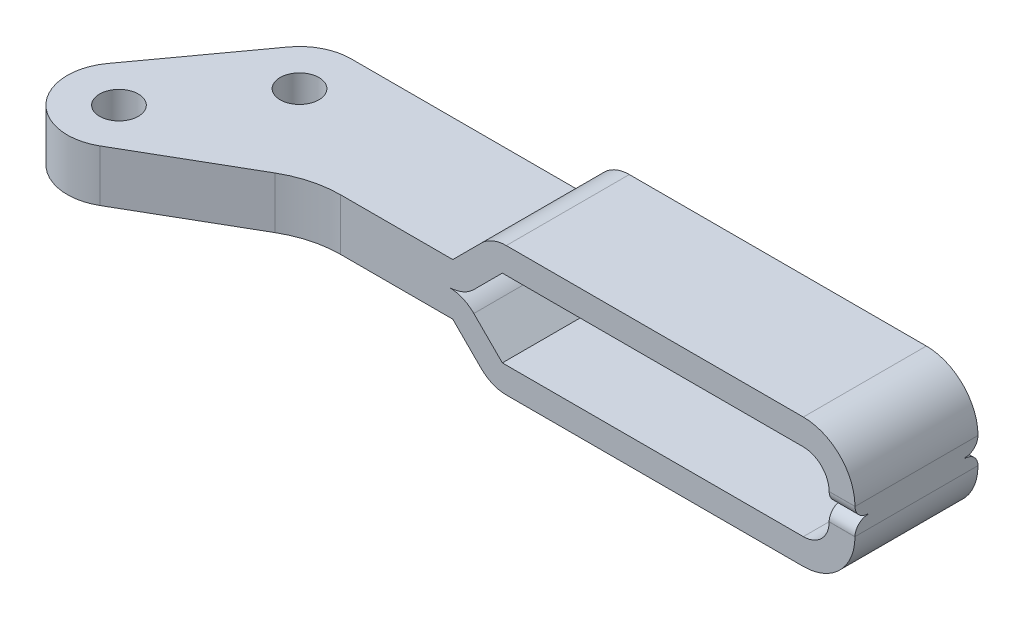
ISO-10303-21;
HEADER;
FILE_DESCRIPTION(('STEP AP214'),'2;1');
FILE_NAME('part.step','',(''),(''),'','','');
FILE_SCHEMA(('AUTOMOTIVE_DESIGN { 1 0 10303 214 1 1 1 1 }'));
ENDSEC;
DATA;
#1=APPLICATION_CONTEXT('core data for automotive mechanical design processes');
#2=APPLICATION_PROTOCOL_DEFINITION('international standard','automotive_design',2000,#1);
#3=PRODUCT_CONTEXT('',#1,'mechanical');
#4=PRODUCT('Part','Part','',(#3));
#5=PRODUCT_RELATED_PRODUCT_CATEGORY('part','',(#4));
#6=PRODUCT_DEFINITION_FORMATION('','',#4);
#7=PRODUCT_DEFINITION_CONTEXT('part definition',#1,'design');
#8=PRODUCT_DEFINITION('design','',#6,#7);
#9=PRODUCT_DEFINITION_SHAPE('','',#8);
#10=(LENGTH_UNIT() NAMED_UNIT(*) SI_UNIT(.MILLI.,.METRE.));
#11=(NAMED_UNIT(*) PLANE_ANGLE_UNIT() SI_UNIT($,.RADIAN.));
#12=(NAMED_UNIT(*) SI_UNIT($,.STERADIAN.) SOLID_ANGLE_UNIT());
#13=UNCERTAINTY_MEASURE_WITH_UNIT(LENGTH_MEASURE(1.E-05),#10,'distance_accuracy_value','');
#14=(GEOMETRIC_REPRESENTATION_CONTEXT(3) GLOBAL_UNCERTAINTY_ASSIGNED_CONTEXT((#13)) GLOBAL_UNIT_ASSIGNED_CONTEXT((#10,
#11,#12)) REPRESENTATION_CONTEXT('',''));
#15=CARTESIAN_POINT('',(0.,0.,0.));
#16=DIRECTION('',(0.,0.,1.));
#17=DIRECTION('',(1.,0.,0.));
#18=AXIS2_PLACEMENT_3D('',#15,#16,#17);
#19=CARTESIAN_POINT('',(52.4137206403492,1.02232003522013,-11.096318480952));
#20=DIRECTION('',(1.,0.,0.));
#21=DIRECTION('',(0.,1.,0.));
#22=AXIS2_PLACEMENT_3D('',#19,#20,#21);
#23=CYLINDRICAL_SURFACE('',#22,1.);
#24=CARTESIAN_POINT('',(54.4137206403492,1.02232003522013,-11.096318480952));
#25=DIRECTION('',(1.,0.,0.));
#26=DIRECTION('',(0.,1.,0.));
#27=AXIS2_PLACEMENT_3D('',#24,#25,#26);
#28=CIRCLE('',#27,1.);
#29=CARTESIAN_POINT('',(54.4137206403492,1.00993105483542,-12.0962417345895));
#30=VERTEX_POINT('',#29);
#31=CARTESIAN_POINT('',(54.4137206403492,0.0223200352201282,-11.096318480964));
#32=VERTEX_POINT('',#31);
#33=EDGE_CURVE('E187',#30,#32,#28,.F.);
#34=ORIENTED_EDGE('',*,*,#33,.T.);
#35=DIRECTION('',(-1.,0.,0.));
#36=VECTOR('',#35,1.);
#37=CARTESIAN_POINT('',(52.4137206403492,0.0223200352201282,-11.0963184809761));
#38=LINE('',#37,#36);
#39=CARTESIAN_POINT('',(52.4137206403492,0.0223200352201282,-11.096318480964));
#40=VERTEX_POINT('',#39);
#41=EDGE_CURVE('E439',#32,#40,#38,.T.);
#42=ORIENTED_EDGE('',*,*,#41,.T.);
#43=CARTESIAN_POINT('',(52.4137206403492,1.02232003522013,-11.096318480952));
#44=DIRECTION('',(1.,0.,0.));
#45=DIRECTION('',(0.,1.,0.));
#46=AXIS2_PLACEMENT_3D('',#43,#44,#45);
#47=CIRCLE('',#46,1.);
#48=CARTESIAN_POINT('',(52.4137206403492,1.00993105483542,-12.0962417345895));
#49=VERTEX_POINT('',#48);
#50=EDGE_CURVE('E533',#49,#40,#47,.F.);
#51=ORIENTED_EDGE('',*,*,#50,.F.);
#52=DIRECTION('',(1.,0.,0.));
#53=VECTOR('',#52,1.);
#54=CARTESIAN_POINT('',(53.4137206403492,1.00993105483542,-12.0962417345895));
#55=LINE('',#54,#53);
#56=EDGE_CURVE('E431',#49,#30,#55,.T.);
#57=ORIENTED_EDGE('',*,*,#56,.T.);
#58=EDGE_LOOP('',(#34,#42,#51,#57));
#59=FACE_BOUND('',#58,.T.);
#60=ADVANCED_FACE('F14',(#59),#23,.T.);
#61=CARTESIAN_POINT('',(52.4137206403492,1.02232003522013,-3.5713184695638));
#62=DIRECTION('',(1.,0.,0.));
#63=DIRECTION('',(0.,1.,0.));
#64=AXIS2_PLACEMENT_3D('',#61,#62,#63);
#65=CYLINDRICAL_SURFACE('',#64,1.);
#66=CARTESIAN_POINT('',(52.4137206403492,1.02232003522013,-3.5713184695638));
#67=DIRECTION('',(1.,0.,0.));
#68=DIRECTION('',(0.,1.,0.));
#69=AXIS2_PLACEMENT_3D('',#66,#67,#68);
#70=CIRCLE('',#69,1.);
#71=CARTESIAN_POINT('',(52.4137206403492,0.0223200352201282,-3.57131847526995));
#72=VERTEX_POINT('',#71);
#73=CARTESIAN_POINT('',(52.4137206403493,1.00993105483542,-2.57139521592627));
#74=VERTEX_POINT('',#73);
#75=EDGE_CURVE('E442',#72,#74,#70,.F.);
#76=ORIENTED_EDGE('',*,*,#75,.F.);
#77=DIRECTION('',(-1.,0.,0.));
#78=VECTOR('',#77,1.);
#79=CARTESIAN_POINT('',(52.4137206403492,0.0223200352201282,-3.57131848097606));
#80=LINE('',#79,#78);
#81=CARTESIAN_POINT('',(54.4137206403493,0.0223200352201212,-3.57131847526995));
#82=VERTEX_POINT('',#81);
#83=EDGE_CURVE('E434',#72,#82,#80,.F.);
#84=ORIENTED_EDGE('',*,*,#83,.T.);
#85=CARTESIAN_POINT('',(54.4137206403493,1.02232003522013,-3.57131846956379));
#86=DIRECTION('',(1.,0.,0.));
#87=DIRECTION('',(0.,1.,0.));
#88=AXIS2_PLACEMENT_3D('',#85,#86,#87);
#89=CIRCLE('',#88,1.);
#90=CARTESIAN_POINT('',(54.4137206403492,1.00993105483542,-2.57139521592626));
#91=VERTEX_POINT('',#90);
#92=EDGE_CURVE('E528',#82,#91,#89,.F.);
#93=ORIENTED_EDGE('',*,*,#92,.T.);
#94=DIRECTION('',(-1.,0.,0.));
#95=VECTOR('',#94,1.);
#96=CARTESIAN_POINT('',(53.4137206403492,1.00993105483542,-2.57139521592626));
#97=LINE('',#96,#95);
#98=EDGE_CURVE('E338',#91,#74,#97,.T.);
#99=ORIENTED_EDGE('',*,*,#98,.T.);
#100=EDGE_LOOP('',(#76,#84,#93,#99));
#101=FACE_BOUND('',#100,.T.);
#102=ADVANCED_FACE('F743',(#101),#65,.T.);
#103=CARTESIAN_POINT('',(52.4137206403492,1.02232003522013,-11.096318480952));
#104=DIRECTION('',(-1.,0.,0.));
#105=DIRECTION('',(0.,-1.,0.));
#106=AXIS2_PLACEMENT_3D('',#103,#104,#105);
#107=PLANE('',#106);
#108=ORIENTED_EDGE('',*,*,#50,.T.);
#109=DIRECTION('',(0.,1.,0.));
#110=VECTOR('',#109,1.);
#111=CARTESIAN_POINT('',(52.4137206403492,-7.80856592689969,-11.096318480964));
#112=LINE('',#111,#110);
#113=CARTESIAN_POINT('',(52.4137206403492,-0.0223200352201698,-11.096318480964));
#114=VERTEX_POINT('',#113);
#115=EDGE_CURVE('E169',#114,#40,#112,.T.);
#116=ORIENTED_EDGE('',*,*,#115,.F.);
#117=CARTESIAN_POINT('',(52.4137206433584,-1.02232003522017,-11.0963184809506));
#118=DIRECTION('',(-1.,0.,0.));
#119=DIRECTION('',(0.,-1.,0.));
#120=AXIS2_PLACEMENT_3D('',#117,#118,#119);
#121=CIRCLE('',#120,1.);
#122=CARTESIAN_POINT('',(52.4137206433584,-1.00993105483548,-12.0962417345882));
#123=VERTEX_POINT('',#122);
#124=EDGE_CURVE('E164',#123,#114,#121,.F.);
#125=ORIENTED_EDGE('',*,*,#124,.F.);
#126=DIRECTION('',(0.,0.,1.));
#127=VECTOR('',#126,1.);
#128=CARTESIAN_POINT('',(52.4137206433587,-1.00993105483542,-18.9863628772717));
#129=LINE('',#128,#127);
#130=CARTESIAN_POINT('',(52.4137206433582,-1.00993105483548,-2.57139521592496));
#131=VERTEX_POINT('',#130);
#132=EDGE_CURVE('E152',#123,#131,#129,.T.);
#133=ORIENTED_EDGE('',*,*,#132,.T.);
#134=CARTESIAN_POINT('',(52.4137206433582,-1.02232003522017,-3.57131846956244));
#135=DIRECTION('',(-1.,0.,0.));
#136=DIRECTION('',(0.,-1.,0.));
#137=AXIS2_PLACEMENT_3D('',#134,#135,#136);
#138=CIRCLE('',#137,1.);
#139=CARTESIAN_POINT('',(52.4137206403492,-0.022320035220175,-3.57131847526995));
#140=VERTEX_POINT('',#139);
#141=EDGE_CURVE('E133',#140,#131,#138,.F.);
#142=ORIENTED_EDGE('',*,*,#141,.F.);
#143=DIRECTION('',(0.,1.,0.));
#144=VECTOR('',#143,1.);
#145=CARTESIAN_POINT('',(52.4137206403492,-7.80856592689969,-3.57131847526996));
#146=LINE('',#145,#144);
#147=EDGE_CURVE('E510',#140,#72,#146,.T.);
#148=ORIENTED_EDGE('',*,*,#147,.T.);
#149=ORIENTED_EDGE('',*,*,#75,.T.);
#150=DIRECTION('',(0.,0.,1.));
#151=VECTOR('',#150,1.);
#152=CARTESIAN_POINT('',(52.4137206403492,1.00993105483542,-18.1473394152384));
#153=LINE('',#152,#151);
#154=EDGE_CURVE('E375',#74,#49,#153,.F.);
#155=ORIENTED_EDGE('',*,*,#154,.T.);
#156=EDGE_LOOP('',(#108,#116,#125,#133,#142,#148,#149,#155));
#157=FACE_BOUND('',#156,.T.);
#158=ADVANCED_FACE('F166',(#157),#107,.T.);
#159=CARTESIAN_POINT('',(54.4136865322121,1.02644964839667,-12.096318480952));
#160=CARTESIAN_POINT('',(54.4137092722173,1.02094317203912,-12.0963120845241));
#161=CARTESIAN_POINT('',(54.4137206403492,1.01543695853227,-12.0962865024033));
#162=CARTESIAN_POINT('',(54.4137206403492,1.00993105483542,-12.0962417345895));
#163=CARTESIAN_POINT('',(52.4137035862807,1.01819035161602,-12.096318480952));
#164=CARTESIAN_POINT('',(52.4137149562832,1.01543711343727,-12.0963120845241));
#165=CARTESIAN_POINT('',(52.4137206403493,1.01268400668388,-12.0962865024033));
#166=CARTESIAN_POINT('',(52.4137206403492,1.00993105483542,-12.0962417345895));
#167=B_SPLINE_SURFACE_WITH_KNOTS('',1,3,((#159,#160,#161,#162),(#163,#164,#165,#166)),
.UNSPECIFIED.,.F.,.F.,.F.,(2,2),(4,4),(0.,1.),(0.,1.),.UNSPECIFIED.);
#168=CARTESIAN_POINT('',(54.4137206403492,1.00993105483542,-12.0962417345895));
#169=CARTESIAN_POINT('',(54.4137206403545,1.01130764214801,-12.0962529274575));
#170=CARTESIAN_POINT('',(54.4137199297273,1.01268423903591,-12.0962629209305));
#171=CARTESIAN_POINT('',(54.4137170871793,1.01543744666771,-12.0962805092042));
#172=CARTESIAN_POINT('',(54.4137149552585,1.01681405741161,-12.096288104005));
#173=CARTESIAN_POINT('',(54.4137064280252,1.02094365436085,-12.0963072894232));
#174=CARTESIAN_POINT('',(54.4136979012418,1.02369665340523,-12.0963152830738));
#175=CARTESIAN_POINT('',(54.4136865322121,1.02644964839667,-12.096318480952));
#176=B_SPLINE_CURVE_WITH_KNOTS('',3,(#168,#169,#170,#171,#172,#173,#174,#175),.UNSPECIFIED.,.F.,
.F.,(4,2,2,4),(0.,0.00412989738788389,0.00825979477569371,0.0165188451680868),.UNSPECIFIED.);
#177=CARTESIAN_POINT('',(54.4136865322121,1.02644964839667,-12.096318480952));
#178=VERTEX_POINT('',#177);
#179=EDGE_CURVE('E339',#30,#178,#176,.T.);
#180=CARTESIAN_POINT('',(52.4137206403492,1.00993105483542,-12.0962417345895));
#181=CARTESIAN_POINT('',(52.413720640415,1.01130746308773,-12.096264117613));
#182=CARTESIAN_POINT('',(52.4137192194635,1.01268394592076,-12.0962817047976));
#183=CARTESIAN_POINT('',(52.4137149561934,1.01474876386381,-12.0963008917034));
#184=CARTESIAN_POINT('',(52.4137131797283,1.01543706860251,-12.0963060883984));
#185=CARTESIAN_POINT('',(52.4137089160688,1.01681369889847,-12.0963140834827));
#186=CARTESIAN_POINT('',(52.413706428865,1.01750202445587,-12.0963168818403));
#187=CARTESIAN_POINT('',(52.4137035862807,1.01819035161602,-12.096318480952));
#188=B_SPLINE_CURVE_WITH_KNOTS('',3,(#180,#181,#182,#183,#184,#185,#186,#187),.UNSPECIFIED.,.F.,
.F.,(4,2,2,4),(0.,0.00412975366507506,0.00619472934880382,0.00825973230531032),.UNSPECIFIED.);
#189=CARTESIAN_POINT('',(52.4137035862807,1.01819035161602,-12.096318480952));
#190=VERTEX_POINT('',#189);
#191=EDGE_CURVE('E367',#49,#190,#188,.T.);
#192=DIRECTION('',(0.999991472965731,0.00412964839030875,0.));
#193=VECTOR('',#192,1.);
#194=CARTESIAN_POINT('',(52.4137035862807,1.01819035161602,-12.096318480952));
#195=LINE('',#194,#193);
#196=EDGE_CURVE('E378',#190,#178,#195,.T.);
#197=ORIENTED_EDGE('',*,*,#179,.F.);
#198=ORIENTED_EDGE('',*,*,#56,.F.);
#199=ORIENTED_EDGE('',*,*,#191,.T.);
#200=ORIENTED_EDGE('',*,*,#196,.T.);
#201=EDGE_LOOP('',(#197,#198,#199,#200));
#202=FACE_BOUND('',#201,.T.);
#203=ADVANCED_FACE('F309',(#202),#167,.F.);
#204=CARTESIAN_POINT('',(54.4137206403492,1.00993105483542,-2.57139521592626));
#205=CARTESIAN_POINT('',(54.4137206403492,1.01543695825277,-2.57135044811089));
#206=CARTESIAN_POINT('',(54.4137092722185,1.02094317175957,-2.57132486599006));
#207=CARTESIAN_POINT('',(54.4136865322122,1.02644964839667,-2.57131846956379));
#208=CARTESIAN_POINT('',(52.4137206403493,1.00993105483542,-2.57139521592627));
#209=CARTESIAN_POINT('',(52.4137206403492,1.01268400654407,-2.5713504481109));
#210=CARTESIAN_POINT('',(52.4137149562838,1.01543711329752,-2.57132486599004));
#211=CARTESIAN_POINT('',(52.4137035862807,1.01819035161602,-2.57131846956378));
#212=B_SPLINE_SURFACE_WITH_KNOTS('',1,3,((#204,#205,#206,#207),(#208,#209,#210,#211)),
.UNSPECIFIED.,.F.,.F.,.F.,(2,2),(4,4),(0.,1.),(0.,1.),.UNSPECIFIED.);
#213=CARTESIAN_POINT('',(54.4136865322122,1.02644964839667,-2.57131846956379));
#214=CARTESIAN_POINT('',(54.4136922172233,1.02507302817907,-2.57132006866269));
#215=CARTESIAN_POINT('',(54.4136971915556,1.02369640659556,-2.57132286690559));
#216=CARTESIAN_POINT('',(54.4137057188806,1.02094316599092,-2.57133086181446));
#217=CARTESIAN_POINT('',(54.4137092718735,1.01956654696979,-2.57133605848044));
#218=CARTESIAN_POINT('',(54.4137177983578,1.01543695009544,-2.57135524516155));
#219=CARTESIAN_POINT('',(54.413720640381,1.01268398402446,-2.57137283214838));
#220=CARTESIAN_POINT('',(54.4137206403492,1.00993105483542,-2.57139521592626));
#221=B_SPLINE_CURVE_WITH_KNOTS('',3,(#213,#214,#215,#216,#217,#218,#219,#220),.UNSPECIFIED.,.F.,
.F.,(4,2,2,4),(0.,0.00412989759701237,0.00825979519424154,0.0165188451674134),.UNSPECIFIED.);
#222=CARTESIAN_POINT('',(54.4136865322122,1.02644964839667,-2.57131846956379));
#223=VERTEX_POINT('',#222);
#224=EDGE_CURVE('E330',#223,#91,#221,.T.);
#225=DIRECTION('',(-0.999991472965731,-0.00412964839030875,0.));
#226=VECTOR('',#225,1.);
#227=CARTESIAN_POINT('',(54.4136865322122,1.02644964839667,-2.57131846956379));
#228=LINE('',#227,#226);
#229=CARTESIAN_POINT('',(52.4137035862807,1.01819035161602,-2.57131846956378));
#230=VERTEX_POINT('',#229);
#231=EDGE_CURVE('E382',#223,#230,#228,.T.);
#232=CARTESIAN_POINT('',(52.4137035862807,1.01819035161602,-2.57131846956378));
#233=CARTESIAN_POINT('',(52.4137092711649,1.01681377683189,-2.57132166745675));
#234=CARTESIAN_POINT('',(52.4137135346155,1.01543721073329,-2.57132966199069));
#235=CARTESIAN_POINT('',(52.4137177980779,1.01337239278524,-2.57134884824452));
#236=CARTESIAN_POINT('',(52.4137188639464,1.01268410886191,-2.57135644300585));
#237=CARTESIAN_POINT('',(52.4137202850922,1.01130756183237,-2.57137403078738));
#238=CARTESIAN_POINT('',(52.4137206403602,1.01061929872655,-2.57138402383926));
#239=CARTESIAN_POINT('',(52.4137206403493,1.00993105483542,-2.57139521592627));
#240=B_SPLINE_CURVE_WITH_KNOTS('',3,(#232,#233,#234,#235,#236,#237,#238,#239),.UNSPECIFIED.,.F.,
.F.,(4,2,2,4),(0.,0.00412975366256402,0.00619472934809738,0.00825973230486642),.UNSPECIFIED.);
#241=EDGE_CURVE('E322',#230,#74,#240,.T.);
#242=ORIENTED_EDGE('',*,*,#224,.F.);
#243=ORIENTED_EDGE('',*,*,#231,.T.);
#244=ORIENTED_EDGE('',*,*,#241,.T.);
#245=ORIENTED_EDGE('',*,*,#98,.F.);
#246=EDGE_LOOP('',(#242,#243,#244,#245));
#247=FACE_BOUND('',#246,.T.);
#248=ADVANCED_FACE('F302',(#247),#212,.F.);
#249=CARTESIAN_POINT('',(50.4137206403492,1.00993105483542,-18.1473394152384));
#250=DIRECTION('',(0.,0.,1.));
#251=DIRECTION('',(0.,-1.,0.));
#252=AXIS2_PLACEMENT_3D('',#249,#250,#251);
#253=CYLINDRICAL_SURFACE('',#252,2.);
#254=CARTESIAN_POINT('',(50.4137206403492,1.00993105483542,-12.096318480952));
#255=DIRECTION('',(0.,0.,1.));
#256=DIRECTION('',(0.,-1.,0.));
#257=AXIS2_PLACEMENT_3D('',#254,#255,#256);
#258=CIRCLE('',#257,2.);
#259=CARTESIAN_POINT('',(50.4137206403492,3.00993105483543,-12.096318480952));
#260=VERTEX_POINT('',#259);
#261=EDGE_CURVE('E374',#260,#190,#258,.F.);
#262=ORIENTED_EDGE('',*,*,#261,.T.);
#263=ORIENTED_EDGE('',*,*,#191,.F.);
#264=ORIENTED_EDGE('',*,*,#154,.F.);
#265=ORIENTED_EDGE('',*,*,#241,.F.);
#266=CARTESIAN_POINT('',(50.4137206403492,1.00993105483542,-2.57131846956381));
#267=DIRECTION('',(0.,0.,1.));
#268=DIRECTION('',(0.,-1.,0.));
#269=AXIS2_PLACEMENT_3D('',#266,#267,#268);
#270=CIRCLE('',#269,2.);
#271=CARTESIAN_POINT('',(50.4137206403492,3.00993105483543,-2.57131846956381));
#272=VERTEX_POINT('',#271);
#273=EDGE_CURVE('E379',#230,#272,#270,.T.);
#274=ORIENTED_EDGE('',*,*,#273,.T.);
#275=DIRECTION('',(0.,0.,1.));
#276=VECTOR('',#275,1.);
#277=CARTESIAN_POINT('',(50.4137206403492,3.00993105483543,-11.096318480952));
#278=LINE('',#277,#276);
#279=EDGE_CURVE('E387',#260,#272,#278,.T.);
#280=ORIENTED_EDGE('',*,*,#279,.F.);
#281=EDGE_LOOP('',(#262,#263,#264,#265,#274,#280));
#282=FACE_BOUND('',#281,.T.);
#283=ADVANCED_FACE('F308',(#282),#253,.F.);
#284=CARTESIAN_POINT('',(54.4137206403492,1.02232003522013,-11.096318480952));
#285=DIRECTION('',(-1.,0.,0.));
#286=DIRECTION('',(0.,-1.,0.));
#287=AXIS2_PLACEMENT_3D('',#284,#285,#286);
#288=PLANE('',#287);
#289=DIRECTION('',(0.,0.,1.));
#290=VECTOR('',#289,1.);
#291=CARTESIAN_POINT('',(54.4137206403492,1.00993105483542,-18.1473394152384));
#292=LINE('',#291,#290);
#293=EDGE_CURVE('E386',#91,#30,#292,.F.);
#294=ORIENTED_EDGE('',*,*,#293,.F.);
#295=ORIENTED_EDGE('',*,*,#92,.F.);
#296=DIRECTION('',(0.,1.,0.));
#297=VECTOR('',#296,1.);
#298=CARTESIAN_POINT('',(54.4137206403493,-7.80856592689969,-3.57131847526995));
#299=LINE('',#298,#297);
#300=CARTESIAN_POINT('',(54.4137206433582,-0.0223200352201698,-3.57131847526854));
#301=VERTEX_POINT('',#300);
#302=EDGE_CURVE('E508',#301,#82,#299,.T.);
#303=ORIENTED_EDGE('',*,*,#302,.F.);
#304=CARTESIAN_POINT('',(54.4137206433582,-1.02232003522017,-3.57131846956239));
#305=DIRECTION('',(-1.,0.,0.));
#306=DIRECTION('',(0.,-1.,0.));
#307=AXIS2_PLACEMENT_3D('',#304,#305,#306);
#308=CIRCLE('',#307,1.);
#309=CARTESIAN_POINT('',(54.4137206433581,-1.00993105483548,-2.57139521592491));
#310=VERTEX_POINT('',#309);
#311=EDGE_CURVE('E525',#301,#310,#308,.F.);
#312=ORIENTED_EDGE('',*,*,#311,.T.);
#313=DIRECTION('',(0.,0.,1.));
#314=VECTOR('',#313,1.);
#315=CARTESIAN_POINT('',(54.4137206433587,-1.00993105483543,-18.9863628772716));
#316=LINE('',#315,#314);
#317=CARTESIAN_POINT('',(54.4137206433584,-1.00993105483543,-12.0962417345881));
#318=VERTEX_POINT('',#317);
#319=EDGE_CURVE('E234',#318,#310,#316,.T.);
#320=ORIENTED_EDGE('',*,*,#319,.F.);
#321=CARTESIAN_POINT('',(54.4137206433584,-1.02232003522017,-11.0963184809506));
#322=DIRECTION('',(-1.,0.,0.));
#323=DIRECTION('',(0.,-1.,0.));
#324=AXIS2_PLACEMENT_3D('',#321,#322,#323);
#325=CIRCLE('',#324,1.);
#326=CARTESIAN_POINT('',(54.4137206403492,-0.0223200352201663,-11.096318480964));
#327=VERTEX_POINT('',#326);
#328=EDGE_CURVE('E177',#318,#327,#325,.F.);
#329=ORIENTED_EDGE('',*,*,#328,.T.);
#330=DIRECTION('',(0.,1.,0.));
#331=VECTOR('',#330,1.);
#332=CARTESIAN_POINT('',(54.4137206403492,-7.80856592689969,-11.096318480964));
#333=LINE('',#332,#331);
#334=EDGE_CURVE('E505',#327,#32,#333,.T.);
#335=ORIENTED_EDGE('',*,*,#334,.T.);
#336=ORIENTED_EDGE('',*,*,#33,.F.);
#337=EDGE_LOOP('',(#294,#295,#303,#312,#320,#329,#335,#336));
#338=FACE_BOUND('',#337,.T.);
#339=ADVANCED_FACE('F357',(#338),#288,.F.);
#340=CARTESIAN_POINT('',(55.1137206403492,3.00993105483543,-11.096318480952));
#341=DIRECTION('',(0.,-1.,0.));
#342=DIRECTION('',(1.,0.,0.));
#343=AXIS2_PLACEMENT_3D('',#340,#341,#342);
#344=PLANE('',#343);
#345=DIRECTION('',(1.,0.,0.));
#346=VECTOR('',#345,1.);
#347=CARTESIAN_POINT('',(18.0692459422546,3.00993105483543,-2.5713184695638));
#348=LINE('',#347,#346);
#349=CARTESIAN_POINT('',(27.1125333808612,3.00993105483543,-2.57131846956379));
#350=VERTEX_POINT('',#349);
#351=EDGE_CURVE('E458',#272,#350,#348,.F.);
#352=ORIENTED_EDGE('',*,*,#351,.T.);
#353=DIRECTION('',(0.,0.,-1.));
#354=VECTOR('',#353,1.);
#355=CARTESIAN_POINT('',(27.1125333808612,3.00993105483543,-11.096318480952));
#356=LINE('',#355,#354);
#357=CARTESIAN_POINT('',(27.1125333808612,3.00993105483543,-12.096318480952));
#358=VERTEX_POINT('',#357);
#359=EDGE_CURVE('E461',#350,#358,#356,.T.);
#360=ORIENTED_EDGE('',*,*,#359,.T.);
#361=DIRECTION('',(1.,0.,0.));
#362=VECTOR('',#361,1.);
#363=CARTESIAN_POINT('',(55.1137206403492,3.00993105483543,-12.096318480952));
#364=LINE('',#363,#362);
#365=EDGE_CURVE('E391',#358,#260,#364,.T.);
#366=ORIENTED_EDGE('',*,*,#365,.T.);
#367=ORIENTED_EDGE('',*,*,#279,.T.);
#368=EDGE_LOOP('',(#352,#360,#366,#367));
#369=FACE_BOUND('',#368,.T.);
#370=ADVANCED_FACE('F351',(#369),#344,.T.);
#371=CARTESIAN_POINT('',(50.4137206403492,1.00993105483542,-18.1473394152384));
#372=DIRECTION('',(0.,0.,1.));
#373=DIRECTION('',(0.,-1.,0.));
#374=AXIS2_PLACEMENT_3D('',#371,#372,#373);
#375=CYLINDRICAL_SURFACE('',#374,4.);
#376=ORIENTED_EDGE('',*,*,#179,.T.);
#377=CARTESIAN_POINT('',(50.4137206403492,1.00993105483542,-12.096318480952));
#378=DIRECTION('',(0.,0.,1.));
#379=DIRECTION('',(0.,-1.,0.));
#380=AXIS2_PLACEMENT_3D('',#377,#378,#379);
#381=CIRCLE('',#380,4.);
#382=CARTESIAN_POINT('',(50.4137206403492,5.00993105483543,-12.096318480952));
#383=VERTEX_POINT('',#382);
#384=EDGE_CURVE('E388',#178,#383,#381,.T.);
#385=ORIENTED_EDGE('',*,*,#384,.T.);
#386=DIRECTION('',(0.,0.,1.));
#387=VECTOR('',#386,1.);
#388=CARTESIAN_POINT('',(50.4137206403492,5.00993105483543,-11.096318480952));
#389=LINE('',#388,#387);
#390=CARTESIAN_POINT('',(50.4137206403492,5.00993105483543,-2.57131846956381));
#391=VERTEX_POINT('',#390);
#392=EDGE_CURVE('E451',#383,#391,#389,.T.);
#393=ORIENTED_EDGE('',*,*,#392,.T.);
#394=CARTESIAN_POINT('',(50.4137206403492,1.00993105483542,-2.57131846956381));
#395=DIRECTION('',(0.,0.,1.));
#396=DIRECTION('',(0.,-1.,0.));
#397=AXIS2_PLACEMENT_3D('',#394,#395,#396);
#398=CIRCLE('',#397,4.);
#399=EDGE_CURVE('E383',#391,#223,#398,.F.);
#400=ORIENTED_EDGE('',*,*,#399,.T.);
#401=ORIENTED_EDGE('',*,*,#224,.T.);
#402=ORIENTED_EDGE('',*,*,#293,.T.);
#403=EDGE_LOOP('',(#376,#385,#393,#400,#401,#402));
#404=FACE_BOUND('',#403,.T.);
#405=ADVANCED_FACE('F345',(#404),#375,.T.);
#406=CARTESIAN_POINT('',(55.1137206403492,5.00993105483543,-11.096318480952));
#407=DIRECTION('',(0.,-1.,0.));
#408=DIRECTION('',(1.,0.,0.));
#409=AXIS2_PLACEMENT_3D('',#406,#407,#408);
#410=PLANE('',#409);
#411=DIRECTION('',(1.,0.,0.));
#412=VECTOR('',#411,1.);
#413=CARTESIAN_POINT('',(55.1137206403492,5.00993105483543,-12.096318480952));
#414=LINE('',#413,#412);
#415=CARTESIAN_POINT('',(27.4176430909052,5.00993105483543,-12.0963184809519));
#416=VERTEX_POINT('',#415);
#417=EDGE_CURVE('E455',#416,#383,#414,.T.);
#418=ORIENTED_EDGE('',*,*,#417,.F.);
#419=DIRECTION('',(0.,0.,-1.));
#420=VECTOR('',#419,1.);
#421=CARTESIAN_POINT('',(27.4176430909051,5.00993105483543,2.49399459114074));
#422=LINE('',#421,#420);
#423=CARTESIAN_POINT('',(27.4176430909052,5.00993105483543,-2.57131846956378));
#424=VERTEX_POINT('',#423);
#425=EDGE_CURVE('E396',#424,#416,#422,.T.);
#426=ORIENTED_EDGE('',*,*,#425,.F.);
#427=DIRECTION('',(1.,0.,0.));
#428=VECTOR('',#427,1.);
#429=CARTESIAN_POINT('',(55.1137206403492,5.00993105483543,-2.5713184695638));
#430=LINE('',#429,#428);
#431=EDGE_CURVE('E464',#391,#424,#430,.F.);
#432=ORIENTED_EDGE('',*,*,#431,.F.);
#433=ORIENTED_EDGE('',*,*,#392,.F.);
#434=EDGE_LOOP('',(#418,#426,#432,#433));
#435=FACE_BOUND('',#434,.T.);
#436=ADVANCED_FACE('F350',(#435),#410,.F.);
#437=CARTESIAN_POINT('',(47.4453112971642,23.3427089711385,-11.096318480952));
#438=DIRECTION('',(0.707106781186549,-0.707106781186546,0.));
#439=DIRECTION('',(0.707106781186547,0.707106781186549,0.));
#440=AXIS2_PLACEMENT_3D('',#437,#438,#439);
#441=PLANE('',#440);
#442=DIRECTION('',(-0.707106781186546,-0.707106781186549,0.));
#443=VECTOR('',#442,1.);
#444=CARTESIAN_POINT('',(26.8967882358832,2.79418590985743,-2.57131846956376));
#445=LINE('',#444,#443);
#446=CARTESIAN_POINT('',(24.9041339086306,0.801531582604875,-2.57131846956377));
#447=VERTEX_POINT('',#446);
#448=EDGE_CURVE('E399',#350,#447,#445,.T.);
#449=ORIENTED_EDGE('',*,*,#448,.T.);
#450=DIRECTION('',(0.,0.,-1.));
#451=VECTOR('',#450,1.);
#452=CARTESIAN_POINT('',(24.9041339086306,0.801531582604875,2.49399459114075));
#453=LINE('',#452,#451);
#454=CARTESIAN_POINT('',(24.9041339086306,0.801531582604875,-12.096318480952));
#455=VERTEX_POINT('',#454);
#456=EDGE_CURVE('E404',#455,#447,#453,.F.);
#457=ORIENTED_EDGE('',*,*,#456,.F.);
#458=DIRECTION('',(0.707106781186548,0.707106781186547,0.));
#459=VECTOR('',#458,1.);
#460=CARTESIAN_POINT('',(24.9041339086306,0.801531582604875,-12.096318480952));
#461=LINE('',#460,#459);
#462=EDGE_CURVE('E454',#455,#358,#461,.T.);
#463=ORIENTED_EDGE('',*,*,#462,.T.);
#464=ORIENTED_EDGE('',*,*,#359,.F.);
#465=EDGE_LOOP('',(#449,#457,#463,#464));
#466=FACE_BOUND('',#465,.T.);
#467=ADVANCED_FACE('F706',(#466),#441,.T.);
#468=CARTESIAN_POINT('',(27.4176430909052,2.27333105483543,2.49399459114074));
#469=DIRECTION('',(0.,0.,-1.));
#470=DIRECTION('',(1.,0.,0.));
#471=AXIS2_PLACEMENT_3D('',#468,#469,#470);
#472=CYLINDRICAL_SURFACE('',#471,2.7366);
#473=DIRECTION('',(0.,0.,1.));
#474=VECTOR('',#473,1.);
#475=CARTESIAN_POINT('',(25.4825746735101,4.20839947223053,-11.096318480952));
#476=LINE('',#475,#474);
#477=CARTESIAN_POINT('',(25.4825746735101,4.20839947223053,-12.0963184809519));
#478=VERTEX_POINT('',#477);
#479=CARTESIAN_POINT('',(25.4825746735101,4.20839947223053,-2.57131846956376));
#480=VERTEX_POINT('',#479);
#481=EDGE_CURVE('E409',#478,#480,#476,.T.);
#482=ORIENTED_EDGE('',*,*,#481,.T.);
#483=CARTESIAN_POINT('',(27.4176430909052,2.27333105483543,-2.57131846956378));
#484=DIRECTION('',(0.,0.,-1.));
#485=DIRECTION('',(1.,0.,0.));
#486=AXIS2_PLACEMENT_3D('',#483,#484,#485);
#487=CIRCLE('',#486,2.7366);
#488=EDGE_CURVE('E395',#480,#424,#487,.T.);
#489=ORIENTED_EDGE('',*,*,#488,.T.);
#490=ORIENTED_EDGE('',*,*,#425,.T.);
#491=CARTESIAN_POINT('',(27.4176430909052,2.27333105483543,-12.096318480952));
#492=DIRECTION('',(0.,0.,-1.));
#493=DIRECTION('',(1.,0.,0.));
#494=AXIS2_PLACEMENT_3D('',#491,#492,#493);
#495=CIRCLE('',#494,2.7366);
#496=EDGE_CURVE('E392',#416,#478,#495,.F.);
#497=ORIENTED_EDGE('',*,*,#496,.T.);
#498=EDGE_LOOP('',(#482,#489,#490,#497));
#499=FACE_BOUND('',#498,.T.);
#500=ADVANCED_FACE('F720',(#499),#472,.T.);
#501=CARTESIAN_POINT('',(22.9690654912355,2.7366,2.49399459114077));
#502=DIRECTION('',(0.,0.,-1.));
#503=DIRECTION('',(0.,1.,0.));
#504=AXIS2_PLACEMENT_3D('',#501,#502,#503);
#505=CYLINDRICAL_SURFACE('',#504,2.7366);
#506=ORIENTED_EDGE('',*,*,#456,.T.);
#507=CARTESIAN_POINT('',(22.9690654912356,2.7366,-2.5713184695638));
#508=DIRECTION('',(0.,0.,-1.));
#509=DIRECTION('',(0.,1.,0.));
#510=AXIS2_PLACEMENT_3D('',#507,#508,#509);
#511=CIRCLE('',#510,2.7366);
#512=CARTESIAN_POINT('',(22.9690654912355,0.,-2.5713184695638));
#513=VERTEX_POINT('',#512);
#514=EDGE_CURVE('E405',#513,#447,#511,.F.);
#515=ORIENTED_EDGE('',*,*,#514,.F.);
#516=DIRECTION('',(0.,0.,-1.));
#517=VECTOR('',#516,1.);
#518=CARTESIAN_POINT('',(22.9690654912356,0.,-11.096318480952));
#519=LINE('',#518,#517);
#520=CARTESIAN_POINT('',(22.9690654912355,0.,-12.096318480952));
#521=VERTEX_POINT('',#520);
#522=EDGE_CURVE('E408',#521,#513,#519,.F.);
#523=ORIENTED_EDGE('',*,*,#522,.F.);
#524=CARTESIAN_POINT('',(22.9690654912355,2.7366,-12.096318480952));
#525=DIRECTION('',(0.,0.,-1.));
#526=DIRECTION('',(0.,1.,0.));
#527=AXIS2_PLACEMENT_3D('',#524,#525,#526);
#528=CIRCLE('',#527,2.7366);
#529=EDGE_CURVE('E400',#455,#521,#528,.T.);
#530=ORIENTED_EDGE('',*,*,#529,.F.);
#531=EDGE_LOOP('',(#506,#515,#523,#530));
#532=FACE_BOUND('',#531,.T.);
#533=ADVANCED_FACE('F607',(#532),#505,.T.);
#534=CARTESIAN_POINT('',(46.0310977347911,24.7569225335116,-11.096318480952));
#535=DIRECTION('',(0.707106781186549,-0.707106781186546,0.));
#536=DIRECTION('',(0.707106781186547,0.707106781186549,0.));
#537=AXIS2_PLACEMENT_3D('',#534,#535,#536);
#538=PLANE('',#537);
#539=DIRECTION('',(0.707106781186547,0.707106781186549,0.));
#540=VECTOR('',#539,1.);
#541=CARTESIAN_POINT('',(46.0310977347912,24.7569225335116,-12.0963184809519));
#542=LINE('',#541,#540);
#543=CARTESIAN_POINT('',(23.2741752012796,2.,-12.096318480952));
#544=VERTEX_POINT('',#543);
#545=EDGE_CURVE('E473',#544,#478,#542,.T.);
#546=ORIENTED_EDGE('',*,*,#545,.F.);
#547=DIRECTION('',(0.,0.,1.));
#548=VECTOR('',#547,1.);
#549=CARTESIAN_POINT('',(23.2741752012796,2.,-11.096318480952));
#550=LINE('',#549,#548);
#551=CARTESIAN_POINT('',(23.2741752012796,2.,-2.57131846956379));
#552=VERTEX_POINT('',#551);
#553=EDGE_CURVE('E27',#544,#552,#550,.T.);
#554=ORIENTED_EDGE('',*,*,#553,.T.);
#555=DIRECTION('',(0.707106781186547,0.707106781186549,0.));
#556=VECTOR('',#555,1.);
#557=CARTESIAN_POINT('',(46.0310977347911,24.7569225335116,-2.57131846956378));
#558=LINE('',#557,#556);
#559=EDGE_CURVE('E403',#480,#552,#558,.F.);
#560=ORIENTED_EDGE('',*,*,#559,.F.);
#561=ORIENTED_EDGE('',*,*,#481,.F.);
#562=EDGE_LOOP('',(#546,#554,#560,#561));
#563=FACE_BOUND('',#562,.T.);
#564=ADVANCED_FACE('F721',(#563),#538,.F.);
#565=CARTESIAN_POINT('',(5.88231968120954,0.,-8.09631847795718));
#566=DIRECTION('',(0.,1.,0.));
#567=DIRECTION('',(0.,0.,1.));
#568=AXIS2_PLACEMENT_3D('',#565,#566,#567);
#569=CYLINDRICAL_SURFACE('',#568,1.5);
#570=CARTESIAN_POINT('',(5.88231968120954,2.,-8.09631847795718));
#571=DIRECTION('',(0.,1.,0.));
#572=DIRECTION('',(0.,0.,1.));
#573=AXIS2_PLACEMENT_3D('',#570,#571,#572);
#574=CIRCLE('',#573,1.5);
#575=CARTESIAN_POINT('',(5.88231968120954,2.,-6.59631847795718));
#576=VERTEX_POINT('',#575);
#577=EDGE_CURVE('E410',#576,#576,#574,.T.);
#578=ORIENTED_EDGE('',*,*,#577,.T.);
#579=EDGE_LOOP('',(#578));
#580=FACE_BOUND('',#579,.T.);
#581=CARTESIAN_POINT('',(5.8823196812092,-2.,-8.09631847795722));
#582=DIRECTION('',(0.,1.,0.));
#583=DIRECTION('',(-1.,0.,0.));
#584=AXIS2_PLACEMENT_3D('',#581,#582,#583);
#585=CIRCLE('',#584,1.5);
#586=CARTESIAN_POINT('',(4.3823196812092,-2.,-8.09631847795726));
#587=VERTEX_POINT('',#586);
#588=EDGE_CURVE('E184',#587,#587,#585,.T.);
#589=ORIENTED_EDGE('',*,*,#588,.F.);
#590=EDGE_LOOP('',(#589));
#591=FACE_BOUND('',#590,.T.);
#592=ADVANCED_FACE('F781',(#580,#591),#569,.F.);
#593=CARTESIAN_POINT('',(0.,0.,0.));
#594=DIRECTION('',(0.,1.,0.));
#595=DIRECTION('',(0.,0.,1.));
#596=AXIS2_PLACEMENT_3D('',#593,#594,#595);
#597=CYLINDRICAL_SURFACE('',#596,1.50000000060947);
#598=CARTESIAN_POINT('',(0.,2.,0.));
#599=DIRECTION('',(0.,1.,0.));
#600=DIRECTION('',(0.,0.,1.));
#601=AXIS2_PLACEMENT_3D('',#598,#599,#600);
#602=CIRCLE('',#601,1.50000000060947);
#603=CARTESIAN_POINT('',(0.,2.,1.50000000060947));
#604=VERTEX_POINT('',#603);
#605=EDGE_CURVE('E413',#604,#604,#602,.T.);
#606=ORIENTED_EDGE('',*,*,#605,.T.);
#607=EDGE_LOOP('',(#606));
#608=FACE_BOUND('',#607,.T.);
#609=CARTESIAN_POINT('',(-5.89805981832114E-13,-2.,-2.01227923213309E-13));
#610=DIRECTION('',(0.,1.,0.));
#611=DIRECTION('',(-1.,0.,0.));
#612=AXIS2_PLACEMENT_3D('',#609,#610,#611);
#613=CIRCLE('',#612,1.50000000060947);
#614=CARTESIAN_POINT('',(-1.50000000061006,-2.,-2.45410679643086E-13));
#615=VERTEX_POINT('',#614);
#616=EDGE_CURVE('E188',#615,#615,#613,.T.);
#617=ORIENTED_EDGE('',*,*,#616,.F.);
#618=EDGE_LOOP('',(#617));
#619=FACE_BOUND('',#618,.T.);
#620=ADVANCED_FACE('F778',(#608,#619),#597,.F.);
#621=CARTESIAN_POINT('',(14.597247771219,0.,5.42868152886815));
#622=DIRECTION('',(0.,1.,0.));
#623=DIRECTION('',(0.,0.,1.));
#624=AXIS2_PLACEMENT_3D('',#621,#622,#623);
#625=CYLINDRICAL_SURFACE('',#624,7.99999999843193);
#626=DIRECTION('',(0.,-1.,0.));
#627=VECTOR('',#626,1.);
#628=CARTESIAN_POINT('',(10.5972477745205,0.,-1.49952170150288));
#629=LINE('',#628,#627);
#630=CARTESIAN_POINT('',(10.5972477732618,2.,-1.49952170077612));
#631=VERTEX_POINT('',#630);
#632=CARTESIAN_POINT('',(10.5972477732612,-2.,-1.49952170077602));
#633=VERTEX_POINT('',#632);
#634=EDGE_CURVE('E483',#631,#633,#629,.T.);
#635=ORIENTED_EDGE('',*,*,#634,.T.);
#636=CARTESIAN_POINT('',(14.5972477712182,-2.,5.42868152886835));
#637=DIRECTION('',(0.,1.,0.));
#638=DIRECTION('',(-1.,0.,0.));
#639=AXIS2_PLACEMENT_3D('',#636,#637,#638);
#640=CIRCLE('',#639,7.99999999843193);
#641=CARTESIAN_POINT('',(14.5972477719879,-2.,-2.57131846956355));
#642=VERTEX_POINT('',#641);
#643=EDGE_CURVE('E207',#642,#633,#640,.T.);
#644=ORIENTED_EDGE('',*,*,#643,.F.);
#645=DIRECTION('',(0.,1.,0.));
#646=VECTOR('',#645,1.);
#647=CARTESIAN_POINT('',(14.5972477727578,0.,-2.57131846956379));
#648=LINE('',#647,#646);
#649=CARTESIAN_POINT('',(14.5972477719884,2.,-2.5713184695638));
#650=VERTEX_POINT('',#649);
#651=EDGE_CURVE('E414',#642,#650,#648,.T.);
#652=ORIENTED_EDGE('',*,*,#651,.T.);
#653=CARTESIAN_POINT('',(14.597247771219,2.,5.42868152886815));
#654=DIRECTION('',(0.,1.,0.));
#655=DIRECTION('',(0.,0.,1.));
#656=AXIS2_PLACEMENT_3D('',#653,#654,#655);
#657=CIRCLE('',#656,7.99999999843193);
#658=EDGE_CURVE('E417',#650,#631,#657,.T.);
#659=ORIENTED_EDGE('',*,*,#658,.T.);
#660=EDGE_LOOP('',(#635,#644,#652,#659));
#661=FACE_BOUND('',#660,.T.);
#662=ADVANCED_FACE('F667',(#661),#625,.F.);
#663=CARTESIAN_POINT('',(10.5972477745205,0.,-1.49952170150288));
#664=DIRECTION('',(-0.5,0.,-0.866025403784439));
#665=DIRECTION('',(0.866025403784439,0.,-0.5));
#666=AXIS2_PLACEMENT_3D('',#663,#664,#665);
#667=PLANE('',#666);
#668=DIRECTION('',(0.,1.,0.));
#669=VECTOR('',#668,1.);
#670=CARTESIAN_POINT('',(1.9999999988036,0.,3.46410161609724));
#671=LINE('',#670,#669);
#672=CARTESIAN_POINT('',(1.99999999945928,-2.,3.46410161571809));
#673=VERTEX_POINT('',#672);
#674=CARTESIAN_POINT('',(1.99999999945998,2.,3.46410161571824));
#675=VERTEX_POINT('',#674);
#676=EDGE_CURVE('E486',#673,#675,#671,.T.);
#677=ORIENTED_EDGE('',*,*,#676,.F.);
#678=DIRECTION('',(-0.866025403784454,0.,0.499999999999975));
#679=VECTOR('',#678,1.);
#680=CARTESIAN_POINT('',(10.59724777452,-2.,-1.49952170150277));
#681=LINE('',#680,#679);
#682=EDGE_CURVE('E206',#633,#673,#681,.T.);
#683=ORIENTED_EDGE('',*,*,#682,.F.);
#684=ORIENTED_EDGE('',*,*,#634,.F.);
#685=DIRECTION('',(-0.866025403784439,0.,0.5));
#686=VECTOR('',#685,1.);
#687=CARTESIAN_POINT('',(10.5972477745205,2.,-1.49952170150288));
#688=LINE('',#687,#686);
#689=EDGE_CURVE('E420',#631,#675,#688,.T.);
#690=ORIENTED_EDGE('',*,*,#689,.T.);
#691=EDGE_LOOP('',(#677,#683,#684,#690));
#692=FACE_BOUND('',#691,.T.);
#693=ADVANCED_FACE('F676',(#692),#667,.F.);
#694=CARTESIAN_POINT('',(0.,0.,0.));
#695=DIRECTION('',(0.,1.,0.));
#696=DIRECTION('',(0.,0.,1.));
#697=AXIS2_PLACEMENT_3D('',#694,#695,#696);
#698=CYLINDRICAL_SURFACE('',#697,4.0000000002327);
#699=CARTESIAN_POINT('',(0.,2.,0.));
#700=DIRECTION('',(0.,1.,0.));
#701=DIRECTION('',(0.,0.,1.));
#702=AXIS2_PLACEMENT_3D('',#699,#700,#701);
#703=CIRCLE('',#702,4.0000000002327);
#704=CARTESIAN_POINT('',(-3.23606797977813,2.,-2.35114100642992));
#705=VERTEX_POINT('',#704);
#706=EDGE_CURVE('E421',#675,#705,#703,.F.);
#707=ORIENTED_EDGE('',*,*,#706,.T.);
#708=DIRECTION('',(0.,-1.,0.));
#709=VECTOR('',#708,1.);
#710=CARTESIAN_POINT('',(-3.23606797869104,0.,-2.35114100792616));
#711=LINE('',#710,#709);
#712=CARTESIAN_POINT('',(-3.23606797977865,-2.,-2.35114100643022));
#713=VERTEX_POINT('',#712);
#714=EDGE_CURVE('E489',#705,#713,#711,.T.);
#715=ORIENTED_EDGE('',*,*,#714,.T.);
#716=CARTESIAN_POINT('',(-5.89805981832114E-13,-2.,-2.01227923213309E-13));
#717=DIRECTION('',(0.,1.,0.));
#718=DIRECTION('',(-1.,0.,0.));
#719=AXIS2_PLACEMENT_3D('',#716,#717,#718);
#720=CIRCLE('',#719,4.0000000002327);
#721=EDGE_CURVE('E203',#713,#673,#720,.T.);
#722=ORIENTED_EDGE('',*,*,#721,.T.);
#723=ORIENTED_EDGE('',*,*,#676,.T.);
#724=EDGE_LOOP('',(#707,#715,#722,#723));
#725=FACE_BOUND('',#724,.T.);
#726=ADVANCED_FACE('F680',(#725),#698,.T.);
#727=CARTESIAN_POINT('',(-3.23606797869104,0.,-2.35114100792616));
#728=DIRECTION('',(0.809016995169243,0.,0.58778525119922));
#729=DIRECTION('',(-0.58778525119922,0.,0.809016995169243));
#730=AXIS2_PLACEMENT_3D('',#727,#728,#729);
#731=PLANE('',#730);
#732=DIRECTION('',(0.,1.,0.));
#733=VECTOR('',#732,1.);
#734=CARTESIAN_POINT('',(2.64625170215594,0.,-10.4474594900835));
#735=LINE('',#734,#733);
#736=CARTESIAN_POINT('',(2.64625170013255,-2.,-10.4474594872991));
#737=VERTEX_POINT('',#736);
#738=CARTESIAN_POINT('',(2.64625170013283,2.,-10.4474594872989));
#739=VERTEX_POINT('',#738);
#740=EDGE_CURVE('E492',#737,#739,#735,.T.);
#741=ORIENTED_EDGE('',*,*,#740,.F.);
#742=DIRECTION('',(0.587785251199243,0.,-0.809016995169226));
#743=VECTOR('',#742,1.);
#744=CARTESIAN_POINT('',(-3.23606797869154,-2.,-2.35114100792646));
#745=LINE('',#744,#743);
#746=EDGE_CURVE('E202',#713,#737,#745,.T.);
#747=ORIENTED_EDGE('',*,*,#746,.F.);
#748=ORIENTED_EDGE('',*,*,#714,.F.);
#749=DIRECTION('',(0.58778525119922,0.,-0.809016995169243));
#750=VECTOR('',#749,1.);
#751=CARTESIAN_POINT('',(-3.23606797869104,2.,-2.35114100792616));
#752=LINE('',#751,#750);
#753=EDGE_CURVE('E424',#705,#739,#752,.T.);
#754=ORIENTED_EDGE('',*,*,#753,.T.);
#755=EDGE_LOOP('',(#741,#747,#748,#754));
#756=FACE_BOUND('',#755,.T.);
#757=ADVANCED_FACE('F685',(#756),#731,.F.);
#758=CARTESIAN_POINT('',(5.88231968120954,0.,-8.09631847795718));
#759=DIRECTION('',(0.,1.,0.));
#760=DIRECTION('',(0.,0.,1.));
#761=AXIS2_PLACEMENT_3D('',#758,#759,#760);
#762=CYLINDRICAL_SURFACE('',#761,4.00000000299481);
#763=DIRECTION('',(0.,-1.,0.));
#764=VECTOR('',#763,1.);
#765=CARTESIAN_POINT('',(5.88231968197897,0.,-12.096318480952));
#766=LINE('',#765,#764);
#767=CARTESIAN_POINT('',(5.88231968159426,2.,-12.096318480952));
#768=VERTEX_POINT('',#767);
#769=CARTESIAN_POINT('',(5.88231968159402,-2.,-12.096318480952));
#770=VERTEX_POINT('',#769);
#771=EDGE_CURVE('E495',#768,#770,#766,.T.);
#772=ORIENTED_EDGE('',*,*,#771,.T.);
#773=CARTESIAN_POINT('',(5.8823196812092,-2.,-8.09631847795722));
#774=DIRECTION('',(0.,1.,0.));
#775=DIRECTION('',(-1.,0.,0.));
#776=AXIS2_PLACEMENT_3D('',#773,#774,#775);
#777=CIRCLE('',#776,4.00000000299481);
#778=EDGE_CURVE('E198',#770,#737,#777,.T.);
#779=ORIENTED_EDGE('',*,*,#778,.T.);
#780=ORIENTED_EDGE('',*,*,#740,.T.);
#781=CARTESIAN_POINT('',(5.88231968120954,2.,-8.09631847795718));
#782=DIRECTION('',(0.,1.,0.));
#783=DIRECTION('',(0.,0.,1.));
#784=AXIS2_PLACEMENT_3D('',#781,#782,#783);
#785=CIRCLE('',#784,4.00000000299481);
#786=EDGE_CURVE('E425',#739,#768,#785,.F.);
#787=ORIENTED_EDGE('',*,*,#786,.T.);
#788=EDGE_LOOP('',(#772,#779,#780,#787));
#789=FACE_BOUND('',#788,.T.);
#790=ADVANCED_FACE('F690',(#789),#762,.T.);
#791=CARTESIAN_POINT('',(56.2110267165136,0.,-12.096318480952));
#792=DIRECTION('',(0.,0.,1.));
#793=DIRECTION('',(0.,-1.,0.));
#794=AXIS2_PLACEMENT_3D('',#791,#792,#793);
#795=PLANE('',#794);
#796=DIRECTION('',(1.,0.,0.));
#797=VECTOR('',#796,1.);
#798=CARTESIAN_POINT('',(56.2110267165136,2.,-12.096318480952));
#799=LINE('',#798,#797);
#800=EDGE_CURVE('E428',#768,#544,#799,.T.);
#801=ORIENTED_EDGE('',*,*,#800,.T.);
#802=ORIENTED_EDGE('',*,*,#545,.T.);
#803=ORIENTED_EDGE('',*,*,#496,.F.);
#804=ORIENTED_EDGE('',*,*,#417,.T.);
#805=ORIENTED_EDGE('',*,*,#384,.F.);
#806=ORIENTED_EDGE('',*,*,#196,.F.);
#807=ORIENTED_EDGE('',*,*,#261,.F.);
#808=ORIENTED_EDGE('',*,*,#365,.F.);
#809=ORIENTED_EDGE('',*,*,#462,.F.);
#810=ORIENTED_EDGE('',*,*,#529,.T.);
#811=CARTESIAN_POINT('',(22.9690654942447,-2.7366,-12.0963184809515));
#812=DIRECTION('',(0.,0.,1.));
#813=DIRECTION('',(0.707106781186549,-0.707106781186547,0.));
#814=AXIS2_PLACEMENT_3D('',#811,#812,#813);
#815=CIRCLE('',#814,2.7366);
#816=CARTESIAN_POINT('',(24.9041339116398,-0.801531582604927,-12.0963184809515));
#817=VERTEX_POINT('',#816);
#818=EDGE_CURVE('E194',#817,#521,#815,.T.);
#819=ORIENTED_EDGE('',*,*,#818,.F.);
#820=DIRECTION('',(0.707106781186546,-0.707106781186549,0.));
#821=VECTOR('',#820,1.);
#822=CARTESIAN_POINT('',(47.4453113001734,-23.3427089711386,-12.0963184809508));
#823=LINE('',#822,#821);
#824=CARTESIAN_POINT('',(27.1125333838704,-3.00993105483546,-12.096318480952));
#825=VERTEX_POINT('',#824);
#826=EDGE_CURVE('E544',#817,#825,#823,.T.);
#827=ORIENTED_EDGE('',*,*,#826,.T.);
#828=DIRECTION('',(1.,0.,0.));
#829=VECTOR('',#828,1.);
#830=CARTESIAN_POINT('',(55.1137206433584,-3.00993105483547,-12.0963184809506));
#831=LINE('',#830,#829);
#832=CARTESIAN_POINT('',(50.4137206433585,-3.00993105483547,-12.0963184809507));
#833=VERTEX_POINT('',#832);
#834=EDGE_CURVE('E563',#825,#833,#831,.T.);
#835=ORIENTED_EDGE('',*,*,#834,.T.);
#836=CARTESIAN_POINT('',(50.4137206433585,-1.00993105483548,-12.0963184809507));
#837=DIRECTION('',(0.,0.,1.));
#838=DIRECTION('',(-0.707106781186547,-0.707106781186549,0.));
#839=AXIS2_PLACEMENT_3D('',#836,#837,#838);
#840=CIRCLE('',#839,2.);
#841=CARTESIAN_POINT('',(52.4137035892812,-1.01819035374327,-12.0963184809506));
#842=VERTEX_POINT('',#841);
#843=EDGE_CURVE('E217',#833,#842,#840,.T.);
#844=ORIENTED_EDGE('',*,*,#843,.T.);
#845=DIRECTION('',(0.999991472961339,-0.0041296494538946,0.));
#846=VECTOR('',#845,1.);
#847=CARTESIAN_POINT('',(52.4137035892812,-1.01819035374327,-12.0963184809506));
#848=LINE('',#847,#846);
#849=CARTESIAN_POINT('',(54.4136865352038,-1.02644965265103,-12.0963184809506));
#850=VERTEX_POINT('',#849);
#851=EDGE_CURVE('E145',#842,#850,#848,.T.);
#852=ORIENTED_EDGE('',*,*,#851,.T.);
#853=CARTESIAN_POINT('',(50.4137206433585,-1.00993105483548,-12.0963184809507));
#854=DIRECTION('',(0.,0.,1.));
#855=DIRECTION('',(-0.707106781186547,-0.707106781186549,0.));
#856=AXIS2_PLACEMENT_3D('',#853,#854,#855);
#857=CIRCLE('',#856,4.);
#858=CARTESIAN_POINT('',(50.4137206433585,-5.00993105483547,-12.0963184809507));
#859=VERTEX_POINT('',#858);
#860=EDGE_CURVE('E225',#850,#859,#857,.F.);
#861=ORIENTED_EDGE('',*,*,#860,.T.);
#862=DIRECTION('',(1.,0.,0.));
#863=VECTOR('',#862,1.);
#864=CARTESIAN_POINT('',(27.4176430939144,-5.00993105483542,-12.0963184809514));
#865=LINE('',#864,#863);
#866=CARTESIAN_POINT('',(27.4176430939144,-5.00993105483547,-12.0963184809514));
#867=VERTEX_POINT('',#866);
#868=EDGE_CURVE('E219',#867,#859,#865,.T.);
#869=ORIENTED_EDGE('',*,*,#868,.F.);
#870=CARTESIAN_POINT('',(27.4176430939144,-2.27333105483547,-12.0963184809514));
#871=DIRECTION('',(0.,0.,-1.));
#872=DIRECTION('',(-0.707106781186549,0.707106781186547,0.));
#873=AXIS2_PLACEMENT_3D('',#870,#871,#872);
#874=CIRCLE('',#873,2.7366);
#875=CARTESIAN_POINT('',(25.4825746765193,-4.20839947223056,-12.0963184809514));
#876=VERTEX_POINT('',#875);
#877=EDGE_CURVE('E214',#867,#876,#874,.T.);
#878=ORIENTED_EDGE('',*,*,#877,.T.);
#879=DIRECTION('',(0.707106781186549,-0.707106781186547,0.));
#880=VECTOR('',#879,1.);
#881=CARTESIAN_POINT('',(46.0310977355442,-24.7569225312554,-12.0963184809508));
#882=LINE('',#881,#880);
#883=CARTESIAN_POINT('',(23.2741752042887,-2.,-12.096318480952));
#884=VERTEX_POINT('',#883);
#885=EDGE_CURVE('E558',#884,#876,#882,.T.);
#886=ORIENTED_EDGE('',*,*,#885,.F.);
#887=DIRECTION('',(1.,0.,0.));
#888=VECTOR('',#887,1.);
#889=CARTESIAN_POINT('',(5.88231968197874,-2.,-12.096318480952));
#890=LINE('',#889,#888);
#891=EDGE_CURVE('E201',#770,#884,#890,.T.);
#892=ORIENTED_EDGE('',*,*,#891,.F.);
#893=ORIENTED_EDGE('',*,*,#771,.F.);
#894=EDGE_LOOP('',(#801,#802,#803,#804,#805,#806,#807,#808,#809,#810,#819,#827,#835,#844,#852,
#861,#869,#878,#886,#892,#893));
#895=FACE_BOUND('',#894,.T.);
#896=ADVANCED_FACE('F591',(#895),#795,.F.);
#897=CARTESIAN_POINT('',(19.1665520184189,0.,-2.57131846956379));
#898=DIRECTION('',(0.,0.,-1.));
#899=DIRECTION('',(0.,1.,0.));
#900=AXIS2_PLACEMENT_3D('',#897,#898,#899);
#901=PLANE('',#900);
#902=ORIENTED_EDGE('',*,*,#651,.F.);
#903=DIRECTION('',(-1.,0.,0.));
#904=VECTOR('',#903,1.);
#905=CARTESIAN_POINT('',(22.9690654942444,-2.,-2.57131846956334));
#906=LINE('',#905,#904);
#907=CARTESIAN_POINT('',(23.2741752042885,-2.,-2.57131846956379));
#908=VERTEX_POINT('',#907);
#909=EDGE_CURVE('E210',#908,#642,#906,.T.);
#910=ORIENTED_EDGE('',*,*,#909,.F.);
#911=DIRECTION('',(-0.707106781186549,0.707106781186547,0.));
#912=VECTOR('',#911,1.);
#913=CARTESIAN_POINT('',(19.8366984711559,1.43747673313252,-2.57131846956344));
#914=LINE('',#913,#912);
#915=CARTESIAN_POINT('',(25.4825746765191,-4.20839947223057,-2.57131846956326));
#916=VERTEX_POINT('',#915);
#917=EDGE_CURVE('E556',#916,#908,#914,.T.);
#918=ORIENTED_EDGE('',*,*,#917,.F.);
#919=CARTESIAN_POINT('',(27.4176430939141,-2.27333105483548,-2.57131846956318));
#920=DIRECTION('',(0.,0.,-1.));
#921=DIRECTION('',(-0.707106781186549,0.707106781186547,0.));
#922=AXIS2_PLACEMENT_3D('',#919,#920,#921);
#923=CIRCLE('',#922,2.7366);
#924=CARTESIAN_POINT('',(27.4176430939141,-5.00993105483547,-2.57131846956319));
#925=VERTEX_POINT('',#924);
#926=EDGE_CURVE('E211',#916,#925,#923,.F.);
#927=ORIENTED_EDGE('',*,*,#926,.T.);
#928=DIRECTION('',(-1.,0.,0.));
#929=VECTOR('',#928,1.);
#930=CARTESIAN_POINT('',(50.4137206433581,-5.00993105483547,-2.5713184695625));
#931=LINE('',#930,#929);
#932=CARTESIAN_POINT('',(50.4137206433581,-5.00993105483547,-2.5713184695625));
#933=VERTEX_POINT('',#932);
#934=EDGE_CURVE('E568',#933,#925,#931,.T.);
#935=ORIENTED_EDGE('',*,*,#934,.F.);
#936=CARTESIAN_POINT('',(50.4137206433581,-1.00993105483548,-2.57131846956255));
#937=DIRECTION('',(0.,0.,1.));
#938=DIRECTION('',(-0.707106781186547,-0.707106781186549,0.));
#939=AXIS2_PLACEMENT_3D('',#936,#937,#938);
#940=CIRCLE('',#939,4.);
#941=CARTESIAN_POINT('',(54.4136865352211,-1.02644964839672,-2.57131846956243));
#942=VERTEX_POINT('',#941);
#943=EDGE_CURVE('E221',#933,#942,#940,.T.);
#944=ORIENTED_EDGE('',*,*,#943,.T.);
#945=DIRECTION('',(-0.999991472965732,0.00412964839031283,0.));
#946=VECTOR('',#945,1.);
#947=CARTESIAN_POINT('',(54.4136865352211,-1.02644964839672,-2.57131846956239));
#948=LINE('',#947,#946);
#949=CARTESIAN_POINT('',(52.4137035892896,-1.01819035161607,-2.57131846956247));
#950=VERTEX_POINT('',#949);
#951=EDGE_CURVE('E224',#942,#950,#948,.T.);
#952=ORIENTED_EDGE('',*,*,#951,.T.);
#953=CARTESIAN_POINT('',(50.4137206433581,-1.00993105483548,-2.57131846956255));
#954=DIRECTION('',(0.,0.,1.));
#955=DIRECTION('',(-0.707106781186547,-0.707106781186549,0.));
#956=AXIS2_PLACEMENT_3D('',#953,#954,#955);
#957=CIRCLE('',#956,2.);
#958=CARTESIAN_POINT('',(50.4137206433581,-3.00993105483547,-2.57131846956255));
#959=VERTEX_POINT('',#958);
#960=EDGE_CURVE('E159',#950,#959,#957,.F.);
#961=ORIENTED_EDGE('',*,*,#960,.T.);
#962=DIRECTION('',(1.,0.,0.));
#963=VECTOR('',#962,1.);
#964=CARTESIAN_POINT('',(55.1137206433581,-3.00993105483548,-2.57131846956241));
#965=LINE('',#964,#963);
#966=CARTESIAN_POINT('',(27.1125333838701,-3.00993105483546,-2.57131846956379));
#967=VERTEX_POINT('',#966);
#968=EDGE_CURVE('E216',#959,#967,#965,.F.);
#969=ORIENTED_EDGE('',*,*,#968,.T.);
#970=DIRECTION('',(0.707106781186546,-0.707106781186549,0.));
#971=VECTOR('',#970,1.);
#972=CARTESIAN_POINT('',(47.4453113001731,-23.3427089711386,-2.57131846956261));
#973=LINE('',#972,#971);
#974=CARTESIAN_POINT('',(24.9041339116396,-0.801531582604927,-2.57131846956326));
#975=VERTEX_POINT('',#974);
#976=EDGE_CURVE('E541',#967,#975,#973,.F.);
#977=ORIENTED_EDGE('',*,*,#976,.T.);
#978=CARTESIAN_POINT('',(22.9690654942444,-2.7366,-2.57131846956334));
#979=DIRECTION('',(0.,0.,1.));
#980=DIRECTION('',(0.707106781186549,-0.707106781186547,0.));
#981=AXIS2_PLACEMENT_3D('',#978,#979,#980);
#982=CIRCLE('',#981,2.7366);
#983=EDGE_CURVE('E191',#513,#975,#982,.F.);
#984=ORIENTED_EDGE('',*,*,#983,.F.);
#985=ORIENTED_EDGE('',*,*,#514,.T.);
#986=ORIENTED_EDGE('',*,*,#448,.F.);
#987=ORIENTED_EDGE('',*,*,#351,.F.);
#988=ORIENTED_EDGE('',*,*,#273,.F.);
#989=ORIENTED_EDGE('',*,*,#231,.F.);
#990=ORIENTED_EDGE('',*,*,#399,.F.);
#991=ORIENTED_EDGE('',*,*,#431,.T.);
#992=ORIENTED_EDGE('',*,*,#488,.F.);
#993=ORIENTED_EDGE('',*,*,#559,.T.);
#994=DIRECTION('',(1.,0.,0.));
#995=VECTOR('',#994,1.);
#996=CARTESIAN_POINT('',(56.2110267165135,2.,-2.57131846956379));
#997=LINE('',#996,#995);
#998=EDGE_CURVE('E9',#552,#650,#997,.F.);
#999=ORIENTED_EDGE('',*,*,#998,.T.);
#1000=EDGE_LOOP('',(#902,#910,#918,#927,#935,#944,#952,#961,#969,#977,#984,#985,#986,#987,#988,
#989,#990,#991,#992,#993,#999));
#1001=FACE_BOUND('',#1000,.T.);
#1002=ADVANCED_FACE('F586',(#1001),#901,.F.);
#1003=CARTESIAN_POINT('',(56.2110267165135,2.,-11.096318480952));
#1004=DIRECTION('',(0.,-1.,0.));
#1005=DIRECTION('',(0.,0.,-1.));
#1006=AXIS2_PLACEMENT_3D('',#1003,#1004,#1005);
#1007=PLANE('',#1006);
#1008=ORIENTED_EDGE('',*,*,#553,.F.);
#1009=ORIENTED_EDGE('',*,*,#800,.F.);
#1010=ORIENTED_EDGE('',*,*,#786,.F.);
#1011=ORIENTED_EDGE('',*,*,#753,.F.);
#1012=ORIENTED_EDGE('',*,*,#706,.F.);
#1013=ORIENTED_EDGE('',*,*,#689,.F.);
#1014=ORIENTED_EDGE('',*,*,#658,.F.);
#1015=ORIENTED_EDGE('',*,*,#998,.F.);
#1016=EDGE_LOOP('',(#1008,#1009,#1010,#1011,#1012,#1013,#1014,#1015));
#1017=FACE_BOUND('',#1016,.T.);
#1018=ORIENTED_EDGE('',*,*,#605,.F.);
#1019=EDGE_LOOP('',(#1018));
#1020=FACE_BOUND('',#1019,.T.);
#1021=ORIENTED_EDGE('',*,*,#577,.F.);
#1022=EDGE_LOOP('',(#1021));
#1023=FACE_BOUND('',#1022,.T.);
#1024=ADVANCED_FACE('F254',(#1017,#1020,#1023),#1007,.F.);
#1025=CARTESIAN_POINT('',(54.4137206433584,-1.02232003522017,-11.0963184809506));
#1026=DIRECTION('',(-1.,0.,0.));
#1027=DIRECTION('',(0.,-1.,0.));
#1028=AXIS2_PLACEMENT_3D('',#1025,#1026,#1027);
#1029=CYLINDRICAL_SURFACE('',#1028,1.);
#1030=DIRECTION('',(1.,0.,0.));
#1031=VECTOR('',#1030,1.);
#1032=CARTESIAN_POINT('',(54.4137206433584,-0.0223200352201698,-11.0963184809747));
#1033=LINE('',#1032,#1031);
#1034=EDGE_CURVE('E578',#114,#327,#1033,.T.);
#1035=ORIENTED_EDGE('',*,*,#1034,.T.);
#1036=ORIENTED_EDGE('',*,*,#328,.F.);
#1037=DIRECTION('',(1.,0.,0.));
#1038=VECTOR('',#1037,1.);
#1039=CARTESIAN_POINT('',(53.4137206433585,-1.00993105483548,-12.0962417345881));
#1040=LINE('',#1039,#1038);
#1041=EDGE_CURVE('E143',#123,#318,#1040,.T.);
#1042=ORIENTED_EDGE('',*,*,#1041,.F.);
#1043=ORIENTED_EDGE('',*,*,#124,.T.);
#1044=EDGE_LOOP('',(#1035,#1036,#1042,#1043));
#1045=FACE_BOUND('',#1044,.T.);
#1046=ADVANCED_FACE('F175',(#1045),#1029,.T.);
#1047=CARTESIAN_POINT('',(54.4137206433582,-1.02232003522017,-3.57131846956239));
#1048=DIRECTION('',(-1.,0.,0.));
#1049=DIRECTION('',(0.,-1.,0.));
#1050=AXIS2_PLACEMENT_3D('',#1047,#1048,#1049);
#1051=CYLINDRICAL_SURFACE('',#1050,1.);
#1052=DIRECTION('',(1.,0.,0.));
#1053=VECTOR('',#1052,1.);
#1054=CARTESIAN_POINT('',(54.4137206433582,-0.0223200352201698,-3.57131848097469));
#1055=LINE('',#1054,#1053);
#1056=EDGE_CURVE('E148',#301,#140,#1055,.F.);
#1057=ORIENTED_EDGE('',*,*,#1056,.T.);
#1058=ORIENTED_EDGE('',*,*,#141,.T.);
#1059=DIRECTION('',(-1.,0.,0.));
#1060=VECTOR('',#1059,1.);
#1061=CARTESIAN_POINT('',(53.4137206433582,-1.00993105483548,-2.57139521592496));
#1062=LINE('',#1061,#1060);
#1063=EDGE_CURVE('E179',#310,#131,#1062,.T.);
#1064=ORIENTED_EDGE('',*,*,#1063,.F.);
#1065=ORIENTED_EDGE('',*,*,#311,.F.);
#1066=EDGE_LOOP('',(#1057,#1058,#1064,#1065));
#1067=FACE_BOUND('',#1066,.T.);
#1068=ADVANCED_FACE('F249',(#1067),#1051,.T.);
#1069=CARTESIAN_POINT('',(54.4136865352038,-1.02644965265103,-12.0963184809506));
#1070=CARTESIAN_POINT('',(54.413709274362,-1.02094338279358,-12.0963120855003));
#1071=CARTESIAN_POINT('',(54.4137206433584,-1.01543716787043,-12.0962865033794));
#1072=CARTESIAN_POINT('',(54.4137206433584,-1.00993105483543,-12.0962417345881));
#1073=CARTESIAN_POINT('',(52.4137035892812,-1.01819035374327,-12.0963184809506));
#1074=CARTESIAN_POINT('',(52.4137149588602,-1.01543721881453,-12.0963120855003));
#1075=CARTESIAN_POINT('',(52.4137206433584,-1.01268411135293,-12.0962865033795));
#1076=CARTESIAN_POINT('',(52.4137206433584,-1.00993105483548,-12.0962417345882));
#1077=B_SPLINE_SURFACE_WITH_KNOTS('',1,3,((#1069,#1070,#1071,#1072),(#1073,#1074,#1075,#1076)),
.UNSPECIFIED.,.F.,.F.,.F.,(2,2),(4,4),(0.,1.),(0.,1.),.UNSPECIFIED.);
#1078=CARTESIAN_POINT('',(54.4136865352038,-1.02644965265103,-12.0963184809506));
#1079=CARTESIAN_POINT('',(54.4136922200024,-1.02507308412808,-12.0963168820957));
#1080=CARTESIAN_POINT('',(54.4136971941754,-1.02369651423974,-12.0963140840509));
#1081=CARTESIAN_POINT('',(54.4137057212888,-1.02094337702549,-12.0963060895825));
#1082=CARTESIAN_POINT('',(54.4137092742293,-1.01956680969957,-12.0963008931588));
#1083=CARTESIAN_POINT('',(54.4137178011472,-1.01543715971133,-12.096281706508));
#1084=CARTESIAN_POINT('',(54.4137206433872,-1.01268408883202,-12.096264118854));
#1085=CARTESIAN_POINT('',(54.4137206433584,-1.00993105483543,-12.0962417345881));
#1086=B_SPLINE_CURVE_WITH_KNOTS('',3,(#1078,#1079,#1080,#1081,#1082,#1083,#1084,#1085),
.UNSPECIFIED.,.F.,.F.,(4,2,2,4),(0.,0.00412974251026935,0.00825948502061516,0.0165188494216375),.UNSPECIFIED.);
#1087=EDGE_CURVE('E235',#850,#318,#1086,.T.);
#1088=CARTESIAN_POINT('',(52.4137035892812,-1.01819035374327,-12.0963184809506));
#1089=CARTESIAN_POINT('',(52.4137092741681,-1.01681377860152,-12.0963152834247));
#1090=CARTESIAN_POINT('',(52.413713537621,-1.01543721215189,-12.0963072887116));
#1091=CARTESIAN_POINT('',(52.4137178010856,-1.01337239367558,-12.0962881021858));
#1092=CARTESIAN_POINT('',(52.4137188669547,-1.01268410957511,-12.0962805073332));
#1093=CARTESIAN_POINT('',(52.4137202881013,-1.01130756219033,-12.0962629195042));
#1094=CARTESIAN_POINT('',(52.4137206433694,-1.01061929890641,-12.096252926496));
#1095=CARTESIAN_POINT('',(52.4137206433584,-1.00993105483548,-12.0962417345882));
#1096=B_SPLINE_CURVE_WITH_KNOTS('',3,(#1088,#1089,#1090,#1091,#1092,#1093,#1094,#1095),
.UNSPECIFIED.,.F.,.F.,(4,2,2,4),(0.,0.00412975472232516,0.00619473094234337,0.0082597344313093),.UNSPECIFIED.);
#1097=EDGE_CURVE('E138',#842,#123,#1096,.T.);
#1098=ORIENTED_EDGE('',*,*,#1087,.F.);
#1099=ORIENTED_EDGE('',*,*,#851,.F.);
#1100=ORIENTED_EDGE('',*,*,#1097,.T.);
#1101=ORIENTED_EDGE('',*,*,#1041,.T.);
#1102=EDGE_LOOP('',(#1098,#1099,#1100,#1101));
#1103=FACE_BOUND('',#1102,.T.);
#1104=ADVANCED_FACE('F141',(#1103),#1077,.T.);
#1105=CARTESIAN_POINT('',(22.9690654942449,-2.7366,-17.161631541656));
#1106=DIRECTION('',(0.,0.,1.));
#1107=DIRECTION('',(0.707106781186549,-0.707106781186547,0.));
#1108=AXIS2_PLACEMENT_3D('',#1105,#1106,#1107);
#1109=CYLINDRICAL_SURFACE('',#1108,2.7366);
#1110=ORIENTED_EDGE('',*,*,#522,.T.);
#1111=ORIENTED_EDGE('',*,*,#983,.T.);
#1112=DIRECTION('',(0.,0.,1.));
#1113=VECTOR('',#1112,1.);
#1114=CARTESIAN_POINT('',(24.90413391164,-0.801531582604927,-17.161631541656));
#1115=LINE('',#1114,#1113);
#1116=EDGE_CURVE('E197',#975,#817,#1115,.F.);
#1117=ORIENTED_EDGE('',*,*,#1116,.T.);
#1118=ORIENTED_EDGE('',*,*,#818,.T.);
#1119=EDGE_LOOP('',(#1110,#1111,#1117,#1118));
#1120=FACE_BOUND('',#1119,.T.);
#1121=ADVANCED_FACE('F259',(#1120),#1109,.T.);
#1122=CARTESIAN_POINT('',(47.4453113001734,-23.3427089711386,-11.0963184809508));
#1123=DIRECTION('',(-0.707106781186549,-0.707106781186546,0.));
#1124=DIRECTION('',(0.707106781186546,-0.707106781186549,0.));
#1125=AXIS2_PLACEMENT_3D('',#1122,#1123,#1124);
#1126=PLANE('',#1125);
#1127=DIRECTION('',(0.,0.,1.));
#1128=VECTOR('',#1127,1.);
#1129=CARTESIAN_POINT('',(27.1125333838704,-3.00993105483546,-11.0963184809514));
#1130=LINE('',#1129,#1128);
#1131=EDGE_CURVE('E21',#825,#967,#1130,.T.);
#1132=ORIENTED_EDGE('',*,*,#1131,.F.);
#1133=ORIENTED_EDGE('',*,*,#826,.F.);
#1134=ORIENTED_EDGE('',*,*,#1116,.F.);
#1135=ORIENTED_EDGE('',*,*,#976,.F.);
#1136=EDGE_LOOP('',(#1132,#1133,#1134,#1135));
#1137=FACE_BOUND('',#1136,.T.);
#1138=ADVANCED_FACE('F288',(#1137),#1126,.F.);
#1139=CARTESIAN_POINT('',(55.1137206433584,-3.00993105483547,-11.0963184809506));
#1140=DIRECTION('',(0.,-1.,0.));
#1141=DIRECTION('',(1.,0.,0.));
#1142=AXIS2_PLACEMENT_3D('',#1139,#1140,#1141);
#1143=PLANE('',#1142);
#1144=DIRECTION('',(0.,0.,1.));
#1145=VECTOR('',#1144,1.);
#1146=CARTESIAN_POINT('',(50.4137206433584,-3.00993105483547,-11.0963184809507));
#1147=LINE('',#1146,#1145);
#1148=EDGE_CURVE('E562',#833,#959,#1147,.T.);
#1149=ORIENTED_EDGE('',*,*,#1148,.F.);
#1150=ORIENTED_EDGE('',*,*,#834,.F.);
#1151=ORIENTED_EDGE('',*,*,#1131,.T.);
#1152=ORIENTED_EDGE('',*,*,#968,.F.);
#1153=EDGE_LOOP('',(#1149,#1150,#1151,#1152));
#1154=FACE_BOUND('',#1153,.T.);
#1155=ADVANCED_FACE('F279',(#1154),#1143,.F.);
#1156=CARTESIAN_POINT('',(50.4137206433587,-1.00993105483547,-18.9863628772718));
#1157=DIRECTION('',(0.,0.,1.));
#1158=DIRECTION('',(-0.707106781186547,-0.707106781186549,0.));
#1159=AXIS2_PLACEMENT_3D('',#1156,#1157,#1158);
#1160=CYLINDRICAL_SURFACE('',#1159,2.);
#1161=ORIENTED_EDGE('',*,*,#1148,.T.);
#1162=ORIENTED_EDGE('',*,*,#960,.F.);
#1163=CARTESIAN_POINT('',(52.4137206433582,-1.00993105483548,-2.57139521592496));
#1164=CARTESIAN_POINT('',(52.4137206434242,-1.01130746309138,-2.57137283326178));
#1165=CARTESIAN_POINT('',(52.4137192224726,-1.01268394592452,-2.57135524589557));
#1166=CARTESIAN_POINT('',(52.4137149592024,-1.01474876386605,-2.57133605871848));
#1167=CARTESIAN_POINT('',(52.4137131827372,-1.01543706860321,-2.5713308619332));
#1168=CARTESIAN_POINT('',(52.4137089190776,-1.01681369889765,-2.57132286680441));
#1169=CARTESIAN_POINT('',(52.4137064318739,-1.01750202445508,-2.57132006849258));
#1170=CARTESIAN_POINT('',(52.4137035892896,-1.01819035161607,-2.57131846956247));
#1171=B_SPLINE_CURVE_WITH_KNOTS('',3,(#1163,#1164,#1165,#1166,#1167,#1168,#1169,#1170),
.UNSPECIFIED.,.F.,.F.,(4,2,2,4),(0.,0.0041297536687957,0.00619472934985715,0.00825973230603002),.UNSPECIFIED.);
#1172=EDGE_CURVE('E157',#131,#950,#1171,.T.);
#1173=ORIENTED_EDGE('',*,*,#1172,.F.);
#1174=ORIENTED_EDGE('',*,*,#132,.F.);
#1175=ORIENTED_EDGE('',*,*,#1097,.F.);
#1176=ORIENTED_EDGE('',*,*,#843,.F.);
#1177=EDGE_LOOP('',(#1161,#1162,#1173,#1174,#1175,#1176));
#1178=FACE_BOUND('',#1177,.T.);
#1179=ADVANCED_FACE('F155',(#1178),#1160,.F.);
#1180=CARTESIAN_POINT('',(54.4137206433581,-1.00993105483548,-2.57139521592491));
#1181=CARTESIAN_POINT('',(54.4137206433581,-1.01543716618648,-2.57135044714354));
#1182=CARTESIAN_POINT('',(54.4137092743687,-1.02094337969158,-2.5713248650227));
#1183=CARTESIAN_POINT('',(54.4136865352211,-1.02644964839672,-2.57131846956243));
#1184=CARTESIAN_POINT('',(52.4137206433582,-1.00993105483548,-2.57139521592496));
#1185=CARTESIAN_POINT('',(52.4137206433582,-1.01268411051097,-2.57135044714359));
#1186=CARTESIAN_POINT('',(52.4137149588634,-1.01543721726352,-2.57132486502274));
#1187=CARTESIAN_POINT('',(52.4137035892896,-1.01819035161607,-2.57131846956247));
#1188=B_SPLINE_SURFACE_WITH_KNOTS('',1,3,((#1180,#1181,#1182,#1183),(#1184,#1185,#1186,#1187)),
.UNSPECIFIED.,.F.,.F.,.F.,(2,2),(4,4),(0.,1.),(0.,1.),.UNSPECIFIED.);
#1189=CARTESIAN_POINT('',(54.4137206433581,-1.00993105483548,-2.57139521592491));
#1190=CARTESIAN_POINT('',(54.4137206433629,-1.01130759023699,-2.57138402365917));
#1191=CARTESIAN_POINT('',(54.4137199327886,-1.01268413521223,-2.57137403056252));
#1192=CARTESIAN_POINT('',(54.413717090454,-1.01543723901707,-2.57135644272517));
#1193=CARTESIAN_POINT('',(54.4137149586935,-1.01681379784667,-2.57134884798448));
#1194=CARTESIAN_POINT('',(54.413706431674,-1.02094344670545,-2.57132966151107));
#1195=CARTESIAN_POINT('',(54.4136979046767,-1.02369654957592,-2.57132166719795));
#1196=CARTESIAN_POINT('',(54.4136865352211,-1.02644964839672,-2.57131846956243));
#1197=B_SPLINE_CURVE_WITH_KNOTS('',3,(#1189,#1190,#1191,#1192,#1193,#1194,#1195,#1196),
.UNSPECIFIED.,.F.,.F.,(4,2,2,4),(0.,0.00412974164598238,0.00825948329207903,0.0165188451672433),.UNSPECIFIED.);
#1198=EDGE_CURVE('E227',#310,#942,#1197,.T.);
#1199=ORIENTED_EDGE('',*,*,#951,.F.);
#1200=ORIENTED_EDGE('',*,*,#1198,.F.);
#1201=ORIENTED_EDGE('',*,*,#1063,.T.);
#1202=ORIENTED_EDGE('',*,*,#1172,.T.);
#1203=EDGE_LOOP('',(#1199,#1200,#1201,#1202));
#1204=FACE_BOUND('',#1203,.T.);
#1205=ADVANCED_FACE('F16',(#1204),#1188,.T.);
#1206=CARTESIAN_POINT('',(50.4137206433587,-1.00993105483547,-18.9863628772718));
#1207=DIRECTION('',(0.,0.,1.));
#1208=DIRECTION('',(-0.707106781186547,-0.707106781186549,0.));
#1209=AXIS2_PLACEMENT_3D('',#1206,#1207,#1208);
#1210=CYLINDRICAL_SURFACE('',#1209,4.);
#1211=ORIENTED_EDGE('',*,*,#943,.F.);
#1212=DIRECTION('',(0.,0.,1.));
#1213=VECTOR('',#1212,1.);
#1214=CARTESIAN_POINT('',(50.4137206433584,-5.00993105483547,-11.0963184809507));
#1215=LINE('',#1214,#1213);
#1216=EDGE_CURVE('E160',#859,#933,#1215,.T.);
#1217=ORIENTED_EDGE('',*,*,#1216,.F.);
#1218=ORIENTED_EDGE('',*,*,#860,.F.);
#1219=ORIENTED_EDGE('',*,*,#1087,.T.);
#1220=ORIENTED_EDGE('',*,*,#319,.T.);
#1221=ORIENTED_EDGE('',*,*,#1198,.T.);
#1222=EDGE_LOOP('',(#1211,#1217,#1218,#1219,#1220,#1221));
#1223=FACE_BOUND('',#1222,.T.);
#1224=ADVANCED_FACE('F241',(#1223),#1210,.T.);
#1225=CARTESIAN_POINT('',(55.1137206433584,-5.00993105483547,-11.0963184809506));
#1226=DIRECTION('',(0.,-1.,0.));
#1227=DIRECTION('',(1.,0.,0.));
#1228=AXIS2_PLACEMENT_3D('',#1225,#1226,#1227);
#1229=PLANE('',#1228);
#1230=DIRECTION('',(0.,0.,-1.));
#1231=VECTOR('',#1230,1.);
#1232=CARTESIAN_POINT('',(27.4176430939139,-5.00993105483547,2.76774573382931));
#1233=LINE('',#1232,#1231);
#1234=EDGE_CURVE('E566',#867,#925,#1233,.F.);
#1235=ORIENTED_EDGE('',*,*,#1234,.F.);
#1236=ORIENTED_EDGE('',*,*,#868,.T.);
#1237=ORIENTED_EDGE('',*,*,#1216,.T.);
#1238=ORIENTED_EDGE('',*,*,#934,.T.);
#1239=EDGE_LOOP('',(#1235,#1236,#1237,#1238));
#1240=FACE_BOUND('',#1239,.T.);
#1241=ADVANCED_FACE('F246',(#1240),#1229,.T.);
#1242=CARTESIAN_POINT('',(27.4176430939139,-2.27333105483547,2.76774573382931));
#1243=DIRECTION('',(0.,0.,-1.));
#1244=DIRECTION('',(-0.707106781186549,0.707106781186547,0.));
#1245=AXIS2_PLACEMENT_3D('',#1242,#1243,#1244);
#1246=CYLINDRICAL_SURFACE('',#1245,2.7366);
#1247=ORIENTED_EDGE('',*,*,#1234,.T.);
#1248=ORIENTED_EDGE('',*,*,#926,.F.);
#1249=DIRECTION('',(0.,0.,1.));
#1250=VECTOR('',#1249,1.);
#1251=CARTESIAN_POINT('',(25.4825746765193,-4.20839947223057,-11.0963184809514));
#1252=LINE('',#1251,#1250);
#1253=EDGE_CURVE('E80',#876,#916,#1252,.T.);
#1254=ORIENTED_EDGE('',*,*,#1253,.F.);
#1255=ORIENTED_EDGE('',*,*,#877,.F.);
#1256=EDGE_LOOP('',(#1247,#1248,#1254,#1255));
#1257=FACE_BOUND('',#1256,.T.);
#1258=ADVANCED_FACE('F280',(#1257),#1246,.T.);
#1259=CARTESIAN_POINT('',(46.0310977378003,-24.7569225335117,-11.0963184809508));
#1260=DIRECTION('',(-0.707106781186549,-0.707106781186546,0.));
#1261=DIRECTION('',(0.707106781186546,-0.707106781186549,0.));
#1262=AXIS2_PLACEMENT_3D('',#1259,#1260,#1261);
#1263=PLANE('',#1262);
#1264=DIRECTION('',(0.,0.,-1.));
#1265=VECTOR('',#1264,1.);
#1266=CARTESIAN_POINT('',(23.2741752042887,-2.,-11.0963184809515));
#1267=LINE('',#1266,#1265);
#1268=EDGE_CURVE('E547',#908,#884,#1267,.T.);
#1269=ORIENTED_EDGE('',*,*,#1268,.T.);
#1270=ORIENTED_EDGE('',*,*,#885,.T.);
#1271=ORIENTED_EDGE('',*,*,#1253,.T.);
#1272=ORIENTED_EDGE('',*,*,#917,.T.);
#1273=EDGE_LOOP('',(#1269,#1270,#1271,#1272));
#1274=FACE_BOUND('',#1273,.T.);
#1275=ADVANCED_FACE('F284',(#1274),#1263,.T.);
#1276=CARTESIAN_POINT('',(56.2110267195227,-2.,-11.0963184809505));
#1277=DIRECTION('',(0.,-1.,0.));
#1278=DIRECTION('',(1.,0.,0.));
#1279=AXIS2_PLACEMENT_3D('',#1276,#1277,#1278);
#1280=PLANE('',#1279);
#1281=ORIENTED_EDGE('',*,*,#746,.T.);
#1282=ORIENTED_EDGE('',*,*,#778,.F.);
#1283=ORIENTED_EDGE('',*,*,#891,.T.);
#1284=ORIENTED_EDGE('',*,*,#1268,.F.);
#1285=ORIENTED_EDGE('',*,*,#909,.T.);
#1286=ORIENTED_EDGE('',*,*,#643,.T.);
#1287=ORIENTED_EDGE('',*,*,#682,.T.);
#1288=ORIENTED_EDGE('',*,*,#721,.F.);
#1289=EDGE_LOOP('',(#1281,#1282,#1283,#1284,#1285,#1286,#1287,#1288));
#1290=FACE_BOUND('',#1289,.T.);
#1291=ORIENTED_EDGE('',*,*,#588,.T.);
#1292=EDGE_LOOP('',(#1291));
#1293=FACE_BOUND('',#1292,.T.);
#1294=ORIENTED_EDGE('',*,*,#616,.T.);
#1295=EDGE_LOOP('',(#1294));
#1296=FACE_BOUND('',#1295,.T.);
#1297=ADVANCED_FACE('F291',(#1290,#1293,#1296),#1280,.T.);
#1298=CARTESIAN_POINT('',(54.4137206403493,-7.80856592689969,-3.57131847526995));
#1299=DIRECTION('',(0.,0.,-1.));
#1300=DIRECTION('',(-1.,0.,0.));
#1301=AXIS2_PLACEMENT_3D('',#1298,#1299,#1300);
#1302=PLANE('',#1301);
#1303=ORIENTED_EDGE('',*,*,#1056,.F.);
#1304=ORIENTED_EDGE('',*,*,#302,.T.);
#1305=ORIENTED_EDGE('',*,*,#83,.F.);
#1306=ORIENTED_EDGE('',*,*,#147,.F.);
#1307=EDGE_LOOP('',(#1303,#1304,#1305,#1306));
#1308=FACE_BOUND('',#1307,.T.);
#1309=ADVANCED_FACE('F297',(#1308),#1302,.F.);
#1310=CARTESIAN_POINT('',(52.4137206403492,-7.80856592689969,-11.096318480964));
#1311=DIRECTION('',(0.,0.,1.));
#1312=DIRECTION('',(0.,-1.,0.));
#1313=AXIS2_PLACEMENT_3D('',#1310,#1311,#1312);
#1314=PLANE('',#1313);
#1315=ORIENTED_EDGE('',*,*,#1034,.F.);
#1316=ORIENTED_EDGE('',*,*,#115,.T.);
#1317=ORIENTED_EDGE('',*,*,#41,.F.);
#1318=ORIENTED_EDGE('',*,*,#334,.F.);
#1319=EDGE_LOOP('',(#1315,#1316,#1317,#1318));
#1320=FACE_BOUND('',#1319,.T.);
#1321=ADVANCED_FACE('F738',(#1320),#1314,.F.);
#1322=CLOSED_SHELL('',(#60,#102,#158,#203,#248,#283,#339,#370,#405,#436,#467,#500,#533,#564,
#592,#620,#662,#693,#726,#757,#790,#896,#1002,#1024,#1046,#1068,#1104,#1121,#1138,#1155,#1179,
#1205,#1224,#1241,#1258,#1275,#1297,#1309,#1321));
#1323=MANIFOLD_SOLID_BREP('B1',#1322);
#1324=ADVANCED_BREP_SHAPE_REPRESENTATION('',(#18,#1323),#14);
#1325=SHAPE_DEFINITION_REPRESENTATION(#9,#1324);
ENDSEC;
END-ISO-10303-21;
